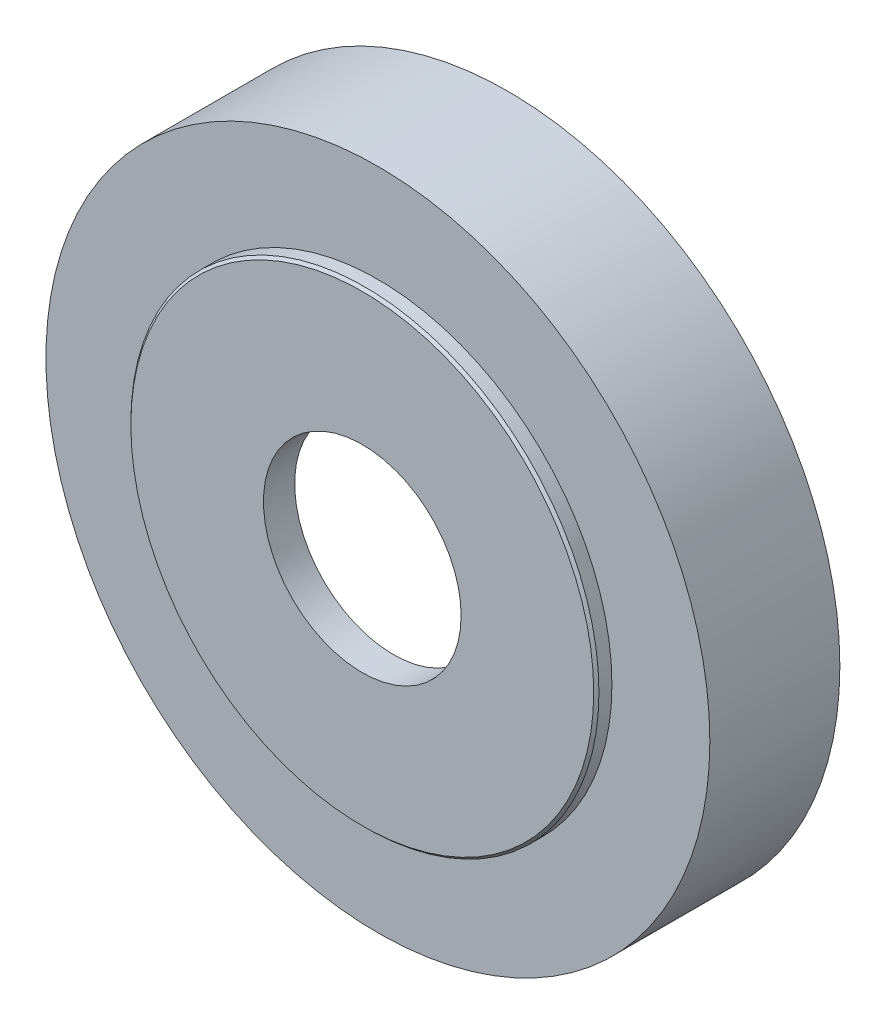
from build123d import *


with BuildPart() as part:
    # Skizze1 → Rotation1 (revolve)
    with BuildSketch(Plane(origin=(0, 0, 0), x_dir=(0, 0, -1), z_dir=(1, 0, 0)), mode=Mode.PRIVATE) as rotation1_sk:
        with BuildLine():
            Line((0, 44.5), (0, 19))
            Line((0, 19), (6, 19))
            Line((6, 19), (6, 45))
            ThreePointArc((6, 45), (7.171572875, 47.828427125), (10, 49))
            Line((10, 49), (25, 49))
            Line((25, 49), (25, 51))
            Line((25, 51), (28, 51))
            Line((28, 51), (28, 63.825))
            Line((28, 63.825), (3, 63.825))
            Line((3, 63.825), (3, 45))
            Line((3, 45), (0.5, 45))
            Line((0.5, 45), (0, 44.5))
        make_face()
    revolve(rotation1_sk.sketch.rotate(Axis((0, 0, -28), (0, 0, 1)), 270), axis=Axis((0, 0, -28), (0, 0, 1)))

    # Skizze2 → Schnitt-Rotation1 (revolve, cut)
    with BuildSketch(Plane.XY.offset(-16), mode=Mode.PRIVATE) as schnitt_rotation1_sk:
        Polygon((16.528123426, -45.410645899), (20.552826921, -43.945773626), (25.484415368, -57.495201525), (26.229090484, -57.842449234), (28.706120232, -56.940884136), (28.877130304, -57.410730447), (21.829435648, -59.975881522), align=None)
    revolve(schnitt_rotation1_sk.sketch.rotate(Axis((21.658425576, -59.506035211, -16), (-0.34202014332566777, 0.9396926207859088, 0)), 180), axis=Axis((21.658425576, -59.506035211, -16), (-0.34202014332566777, 0.9396926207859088, 0)), mode=Mode.SUBTRACT)

    # Skizze3 → Schnitt-Rotation2 (revolve, cut)
    with BuildSketch(Plane.XY.offset(-16), mode=Mode.PRIVATE) as schnitt_rotation2_sk:
        Polygon((-16.528123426, -45.410645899), (-12.503419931, -46.875518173), (-17.435008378, -60.424946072), (-17.087760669, -61.169621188), (-14.61073092, -62.071186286), (-14.781740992, -62.541032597), (-21.829435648, -59.975881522), align=None)
    revolve(schnitt_rotation2_sk.sketch.rotate(Axis((-21.658425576, -59.506035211, -16), (0.34202014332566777, 0.9396926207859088, 0)), 180), axis=Axis((-21.658425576, -59.506035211, -16), (0.34202014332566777, 0.9396926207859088, 0)), mode=Mode.SUBTRACT)


solid = part.part
